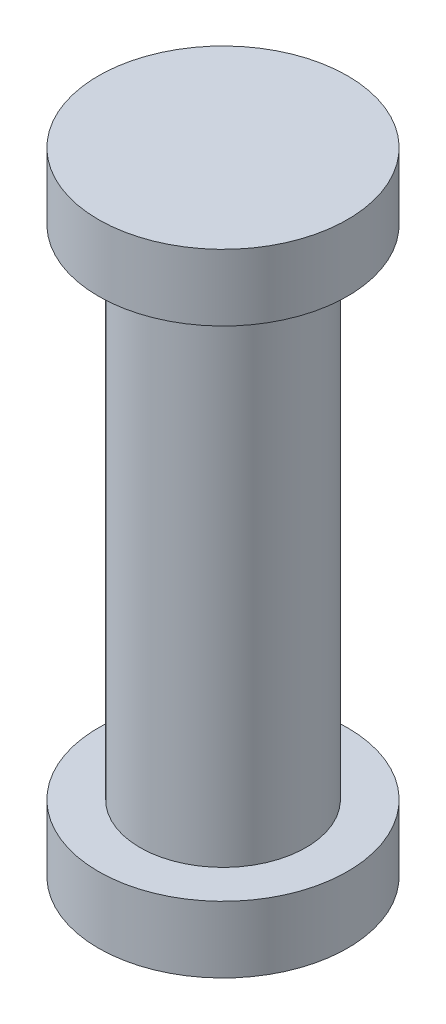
from build123d import *

# Parameters (mm, degrees)
SKETCH1_R                = 3.175
BOSS_EXTRUDE1_DEPTH      = 20.32
SKETCH2_R                = 4.7625
BOSS_EXTRUDE2_DEPTH      = 2.54
BOSS_EXTRUDE3_DEPTH      = 1.27
BOSS_EXTRUDE3_DEPTH_BACK = 1.27
SKETCH3_R                = 4.7625


with BuildPart() as part:
    # Sketch1 → Boss-Extrude1 (new body)
    with BuildSketch(Plane(origin=(0, 0, 0), x_dir=(1, 0, 0), z_dir=(0, 1, 0))):
        with Locations(Location((0, 0, 0), (0, 0, 270))):
            Circle(SKETCH1_R)
    extrude(amount=BOSS_EXTRUDE1_DEPTH)

    # Sketch2 → Boss-Extrude2 (add)
    with BuildSketch(Plane(origin=(0, 0, 0), x_dir=(-1, 0, 0), z_dir=(0, -1, 0))):
        with Locations(Location((0, 0, 0), (0, 0, 90))):
            Circle(SKETCH2_R)
    extrude(amount=BOSS_EXTRUDE2_DEPTH)

    # Sketch3 → Boss-Extrude3 (add, two sides: drawn at the far end of the back side and taken through both)
    with BuildSketch(Plane(origin=(0, 20.32, 0), x_dir=(1, 0, 0), z_dir=(0, 1, 0)).offset(-BOSS_EXTRUDE3_DEPTH_BACK)):
        with Locations(Location((0, 0, 0), (0, 0, 90))):
            Circle(SKETCH3_R)
    extrude(amount=BOSS_EXTRUDE3_DEPTH + BOSS_EXTRUDE3_DEPTH_BACK)


solid = part.part
